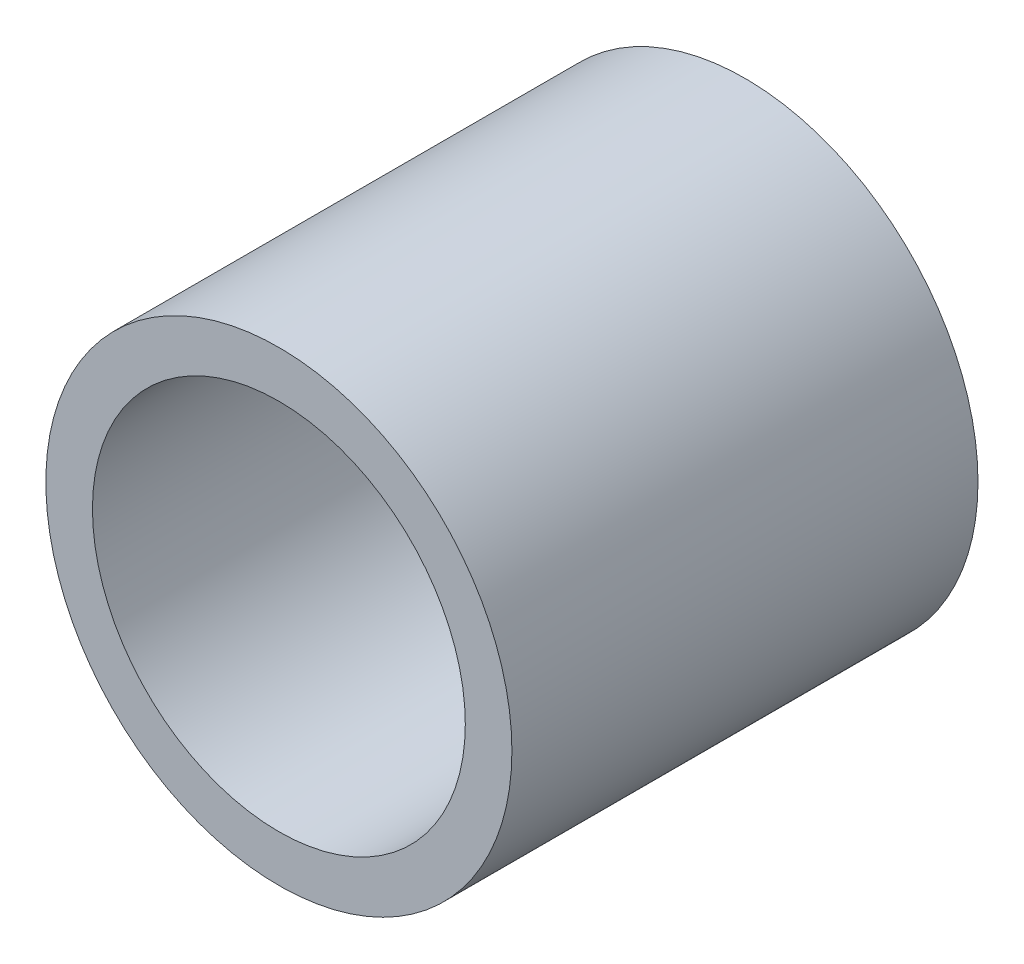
from build123d import *

# Parameters (mm, degrees)
SKETCH1_R      = 12.7
SKETCH1_R_2    = 10.16
EXTRUDE1_DEPTH = 25.4


with BuildPart() as part:
    # Sketch1 → Extrude1 (new body)
    with BuildSketch(Plane.XY):
        Circle(SKETCH1_R)
        Circle(SKETCH1_R_2, mode=Mode.SUBTRACT)
    extrude(amount=EXTRUDE1_DEPTH)


solid = part.part
